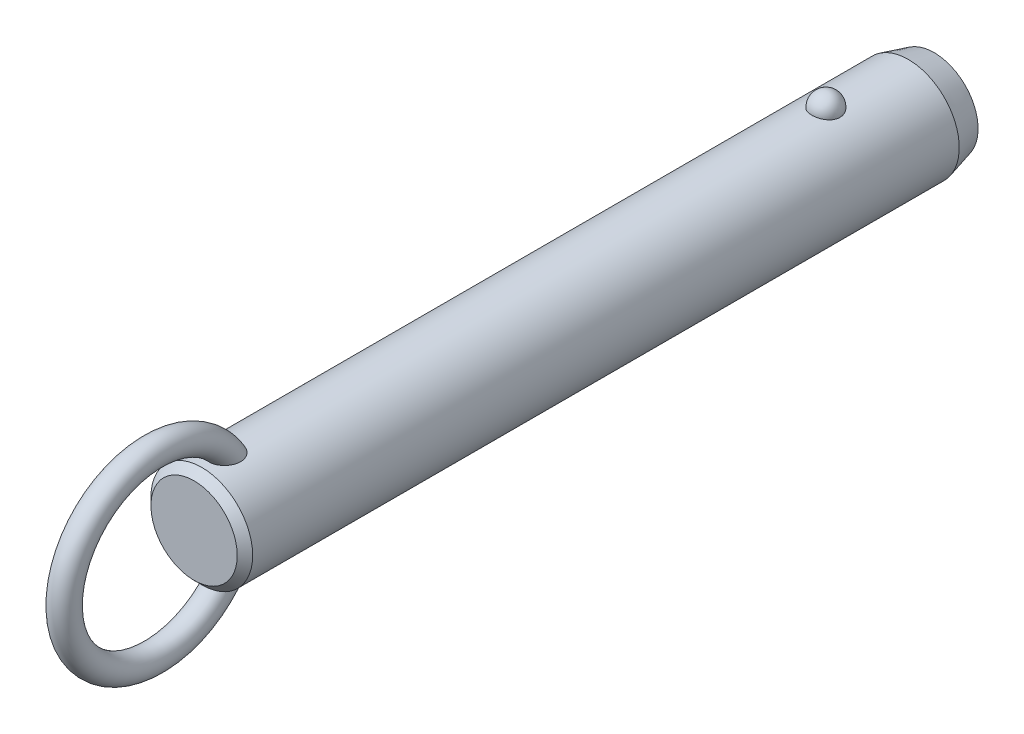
ISO-10303-21;
HEADER;
FILE_DESCRIPTION(('STEP AP214'),'2;1');
FILE_NAME('part.step','',(''),(''),'','','');
FILE_SCHEMA(('AUTOMOTIVE_DESIGN { 1 0 10303 214 1 1 1 1 }'));
ENDSEC;
DATA;
#1=APPLICATION_CONTEXT('core data for automotive mechanical design processes');
#2=APPLICATION_PROTOCOL_DEFINITION('international standard','automotive_design',2000,#1);
#3=PRODUCT_CONTEXT('',#1,'mechanical');
#4=PRODUCT('Part','Part','',(#3));
#5=PRODUCT_RELATED_PRODUCT_CATEGORY('part','',(#4));
#6=PRODUCT_DEFINITION_FORMATION('','',#4);
#7=PRODUCT_DEFINITION_CONTEXT('part definition',#1,'design');
#8=PRODUCT_DEFINITION('design','',#6,#7);
#9=PRODUCT_DEFINITION_SHAPE('','',#8);
#10=(LENGTH_UNIT() NAMED_UNIT(*) SI_UNIT(.MILLI.,.METRE.));
#11=(NAMED_UNIT(*) PLANE_ANGLE_UNIT() SI_UNIT($,.RADIAN.));
#12=(NAMED_UNIT(*) SI_UNIT($,.STERADIAN.) SOLID_ANGLE_UNIT());
#13=UNCERTAINTY_MEASURE_WITH_UNIT(LENGTH_MEASURE(1.E-05),#10,'distance_accuracy_value','');
#14=(GEOMETRIC_REPRESENTATION_CONTEXT(3) GLOBAL_UNCERTAINTY_ASSIGNED_CONTEXT((#13)) GLOBAL_UNIT_ASSIGNED_CONTEXT((#10,
#11,#12)) REPRESENTATION_CONTEXT('',''));
#15=CARTESIAN_POINT('',(0.,0.,0.));
#16=DIRECTION('',(0.,0.,1.));
#17=DIRECTION('',(1.,0.,0.));
#18=AXIS2_PLACEMENT_3D('',#15,#16,#17);
#19=CARTESIAN_POINT('',(0.,0.,86.4));
#20=DIRECTION('',(0.,0.,-1.));
#21=DIRECTION('',(-1.,0.,0.));
#22=AXIS2_PLACEMENT_3D('',#19,#20,#21);
#23=CYLINDRICAL_SURFACE('',#22,7.9);
#24=CARTESIAN_POINT('',(2.1785689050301,7.59367088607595,-2.19999999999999));
#25=CARTESIAN_POINT('',(2.17856679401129,7.59367269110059,-2.07701843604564));
#26=CARTESIAN_POINT('',(2.16853481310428,7.59657145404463,-1.95401006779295));
#27=CARTESIAN_POINT('',(2.12864689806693,7.607843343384,-1.71147811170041));
#28=CARTESIAN_POINT('',(2.09878338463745,7.61621856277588,-1.59195587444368));
#29=CARTESIAN_POINT('',(2.0199931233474,7.63749180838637,-1.3598563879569));
#30=CARTESIAN_POINT('',(1.97107475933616,7.65038784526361,-1.24727610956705));
#31=CARTESIAN_POINT('',(1.85539377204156,7.67926115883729,-1.03213234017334));
#32=CARTESIAN_POINT('',(1.78863158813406,7.69523835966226,-0.929568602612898));
#33=CARTESIAN_POINT('',(1.63856494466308,7.7285848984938,-0.736786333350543));
#34=CARTESIAN_POINT('',(1.55518140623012,7.7459606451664,-0.646630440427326));
#35=CARTESIAN_POINT('',(1.37422937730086,7.78009978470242,-0.481747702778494));
#36=CARTESIAN_POINT('',(1.27666086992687,7.7968631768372,-0.407020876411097));
#37=CARTESIAN_POINT('',(1.07024728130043,7.82786153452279,-0.275278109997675));
#38=CARTESIAN_POINT('',(0.961434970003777,7.84210353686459,-0.218212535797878));
#39=CARTESIAN_POINT('',(0.735351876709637,7.86652194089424,-0.123146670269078));
#40=CARTESIAN_POINT('',(0.618082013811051,7.87669878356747,-0.0851443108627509));
#41=CARTESIAN_POINT('',(0.380637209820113,7.89170521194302,-0.0298158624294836));
#42=CARTESIAN_POINT('',(0.260550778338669,7.89662650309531,-0.0121347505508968));
#43=CARTESIAN_POINT('',(0.0190117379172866,7.90090003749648,0.00324379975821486));
#44=CARTESIAN_POINT('',(-0.10244074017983,7.90025280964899,0.000943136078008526));
#45=CARTESIAN_POINT('',(-0.341452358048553,7.89351056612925,-0.0233955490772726));
#46=CARTESIAN_POINT('',(-0.45904225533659,7.88749257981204,-0.0451545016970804));
#47=CARTESIAN_POINT('',(-0.688796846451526,7.87075812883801,-0.107408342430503));
#48=CARTESIAN_POINT('',(-0.800961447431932,7.86004158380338,-0.147903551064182));
#49=CARTESIAN_POINT('',(-1.01743634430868,7.83497131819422,-0.246799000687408));
#50=CARTESIAN_POINT('',(-1.12169791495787,7.82059709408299,-0.305300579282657));
#51=CARTESIAN_POINT('',(-1.31891765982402,7.78976470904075,-0.438549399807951));
#52=CARTESIAN_POINT('',(-1.41187469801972,7.77330633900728,-0.513298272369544));
#53=CARTESIAN_POINT('',(-1.58577142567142,7.73972434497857,-0.678622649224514));
#54=CARTESIAN_POINT('',(-1.66645140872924,7.72259402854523,-0.769470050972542));
#55=CARTESIAN_POINT('',(-1.81161503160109,7.68983776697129,-0.963538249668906));
#56=CARTESIAN_POINT('',(-1.87609753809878,7.6742119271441,-1.06675991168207));
#57=CARTESIAN_POINT('',(-1.98790138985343,7.6460202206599,-1.28401170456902));
#58=CARTESIAN_POINT('',(-2.03501994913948,7.63349104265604,-1.39815107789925));
#59=CARTESIAN_POINT('',(-2.10986724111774,7.6131449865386,-1.63301784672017));
#60=CARTESIAN_POINT('',(-2.1375965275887,7.60532797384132,-1.75374505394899));
#61=CARTESIAN_POINT('',(-2.17289256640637,7.59531950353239,-1.99782562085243));
#62=CARTESIAN_POINT('',(-2.18054294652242,7.59310471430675,-2.12116592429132));
#63=CARTESIAN_POINT('',(-2.17572919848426,7.59448538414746,-2.36741799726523));
#64=CARTESIAN_POINT('',(-2.1632656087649,7.59808068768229,-2.49032977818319));
#65=CARTESIAN_POINT('',(-2.11865035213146,7.61064035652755,-2.73161015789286));
#66=CARTESIAN_POINT('',(-2.08659579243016,7.61957823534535,-2.84999812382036));
#67=CARTESIAN_POINT('',(-2.00367799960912,7.64179982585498,-3.07955956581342));
#68=CARTESIAN_POINT('',(-1.9528140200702,7.65508371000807,-3.19073275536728));
#69=CARTESIAN_POINT('',(-1.83321113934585,7.68460381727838,-3.40337899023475));
#70=CARTESIAN_POINT('',(-1.76437735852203,7.70085556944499,-3.50479651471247));
#71=CARTESIAN_POINT('',(-1.61069526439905,7.73445734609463,-3.69446912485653));
#72=CARTESIAN_POINT('',(-1.52584634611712,7.75180741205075,-3.78272371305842));
#73=CARTESIAN_POINT('',(-1.34198059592,7.78574608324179,-3.94393987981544));
#74=CARTESIAN_POINT('',(-1.24291308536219,7.80233167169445,-4.01684434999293));
#75=CARTESIAN_POINT('',(-1.03352039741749,7.83281625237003,-4.14489386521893));
#76=CARTESIAN_POINT('',(-0.923196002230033,7.84671543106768,-4.20004014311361));
#77=CARTESIAN_POINT('',(-0.695822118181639,7.87011575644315,-4.29042017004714));
#78=CARTESIAN_POINT('',(-0.578872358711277,7.87966903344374,-4.32589112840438));
#79=CARTESIAN_POINT('',(-0.340410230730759,7.8935652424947,-4.37692226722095));
#80=CARTESIAN_POINT('',(-0.218898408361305,7.89790879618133,-4.39248482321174));
#81=CARTESIAN_POINT('',(0.0228107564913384,7.90087453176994,-4.40314405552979));
#82=CARTESIAN_POINT('',(0.142990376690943,7.89960185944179,-4.39861683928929));
#83=CARTESIAN_POINT('',(0.380829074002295,7.89171262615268,-4.37008293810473));
#84=CARTESIAN_POINT('',(0.498488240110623,7.8850962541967,-4.34607694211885));
#85=CARTESIAN_POINT('',(0.727535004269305,7.86726442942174,-4.27939317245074));
#86=CARTESIAN_POINT('',(0.838944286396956,7.85606616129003,-4.236785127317));
#87=CARTESIAN_POINT('',(1.05295421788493,7.83025654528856,-4.13408348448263));
#88=CARTESIAN_POINT('',(1.15555431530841,7.81564498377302,-4.07398879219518));
#89=CARTESIAN_POINT('',(1.35076763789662,7.7843022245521,-3.93687432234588));
#90=CARTESIAN_POINT('',(1.4432046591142,7.76754209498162,-3.85961036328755));
#91=CARTESIAN_POINT('',(1.6139111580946,7.73387857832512,-3.69076949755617));
#92=CARTESIAN_POINT('',(1.6921781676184,7.71697516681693,-3.59919010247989));
#93=CARTESIAN_POINT('',(1.83380875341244,7.6845643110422,-3.40247278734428));
#94=CARTESIAN_POINT('',(1.89689280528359,7.66908588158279,-3.29712873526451));
#95=CARTESIAN_POINT('',(2.0047823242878,7.64159441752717,-3.07707931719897));
#96=CARTESIAN_POINT('',(2.0495945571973,7.62958010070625,-2.96237743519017));
#97=CARTESIAN_POINT('',(2.11580183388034,7.61146617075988,-2.74040519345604));
#98=CARTESIAN_POINT('',(2.13929812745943,7.60484503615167,-2.63379846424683));
#99=CARTESIAN_POINT('',(2.17068242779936,7.59594664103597,-2.41813481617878));
#100=CARTESIAN_POINT('',(2.17857077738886,7.59366928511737,-2.30907795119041));
#101=CARTESIAN_POINT('',(2.1785689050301,7.59367088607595,-2.19999999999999));
#102=B_SPLINE_CURVE_WITH_KNOTS('',3,(#24,#25,#26,#27,#28,#29,#30,#31,#32,#33,#34,#35,#36,#37,
#38,#39,#40,#41,#42,#43,#44,#45,#46,#47,#48,#49,#50,#51,#52,#53,#54,#55,#56,#57,#58,#59,#60,#61,
#62,#63,#64,#65,#66,#67,#68,#69,#70,#71,#72,#73,#74,#75,#76,#77,#78,#79,#80,#81,#82,#83,#84,#85,
#86,#87,#88,#89,#90,#91,#92,#93,#94,#95,#96,#97,#98,#99,#100,#101),.UNSPECIFIED.,.T.,.F.,(4,2,2,
2,2,2,2,2,2,2,2,2,2,2,2,2,2,2,2,2,2,2,2,2,2,2,2,2,2,2,2,2,2,2,2,2,2,2,4),(0.,0.368552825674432,
0.737246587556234,1.10577831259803,1.4743009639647,1.84462067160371,2.21494081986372,
2.58421058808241,2.95344028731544,3.31611630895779,3.67875788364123,4.03628044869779,
4.39380913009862,4.75338791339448,5.11300280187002,5.47939989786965,5.8458226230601,
6.21639834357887,6.58696347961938,6.95598276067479,7.32499216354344,7.69218715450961,
8.0593967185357,8.42858578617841,8.79778880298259,9.16834203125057,9.5388695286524,
9.90482699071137,10.2707407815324,10.6298333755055,10.9889132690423,11.3466585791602,
11.7044262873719,12.0676511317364,12.4309391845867,12.8004764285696,13.1698767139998,
13.4967701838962,13.8236564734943),.UNSPECIFIED.);
#103=CARTESIAN_POINT('',(2.1785689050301,7.59367088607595,-2.19999999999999));
#104=VERTEX_POINT('',#103);
#105=EDGE_CURVE('E41',#104,#104,#102,.T.);
#106=ORIENTED_EDGE('',*,*,#105,.T.);
#107=EDGE_LOOP('',(#106));
#108=FACE_BOUND('',#107,.T.);
#109=CARTESIAN_POINT('',(0.,0.,94.7200000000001));
#110=DIRECTION('',(0.,0.,1.));
#111=DIRECTION('',(1.,0.,0.));
#112=AXIS2_PLACEMENT_3D('',#109,#110,#111);
#113=CIRCLE('',#112,7.9);
#114=CARTESIAN_POINT('',(7.9,0.,94.7200000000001));
#115=VERTEX_POINT('',#114);
#116=EDGE_CURVE('E10',#115,#115,#113,.F.);
#117=ORIENTED_EDGE('',*,*,#116,.T.);
#118=EDGE_LOOP('',(#117));
#119=FACE_BOUND('',#118,.T.);
#120=CARTESIAN_POINT('',(-0.630969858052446,-7.87476203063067,88.6124322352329));
#121=CARTESIAN_POINT('',(-0.734180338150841,-7.8664899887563,88.647285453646));
#122=CARTESIAN_POINT('',(-0.834476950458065,-7.85639291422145,88.6908160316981));
#123=CARTESIAN_POINT('',(-1.02620356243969,-7.83366343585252,88.7940948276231));
#124=CARTESIAN_POINT('',(-1.1176141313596,-7.82102565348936,88.8538775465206));
#125=CARTESIAN_POINT('',(-1.28877277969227,-7.79464922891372,88.9878390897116));
#126=CARTESIAN_POINT('',(-1.36854014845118,-7.78091246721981,89.061993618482));
#127=CARTESIAN_POINT('',(-1.5146152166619,-7.75380398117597,89.2224941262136));
#128=CARTESIAN_POINT('',(-1.58092966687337,-7.74043207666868,89.3088339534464));
#129=CARTESIAN_POINT('',(-1.70019064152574,-7.71512522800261,89.4929784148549));
#130=CARTESIAN_POINT('',(-1.75284037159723,-7.70322473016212,89.5909792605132));
#131=CARTESIAN_POINT('',(-1.84263464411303,-7.68224112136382,89.7941029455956));
#132=CARTESIAN_POINT('',(-1.87977299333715,-7.6731591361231,89.8992286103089));
#133=CARTESIAN_POINT('',(-1.94152728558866,-7.65777930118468,90.1232849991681));
#134=CARTESIAN_POINT('',(-1.96475471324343,-7.65179654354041,90.2426167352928));
#135=CARTESIAN_POINT('',(-1.99449499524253,-7.64409642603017,90.4834298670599));
#136=CARTESIAN_POINT('',(-2.0010005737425,-7.64238092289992,90.6049121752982));
#137=CARTESIAN_POINT('',(-1.99856014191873,-7.64302120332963,90.8683409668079));
#138=CARTESIAN_POINT('',(-1.98680021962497,-7.64611845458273,91.0102565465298));
#139=CARTESIAN_POINT('',(-1.9445777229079,-7.65696186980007,91.2911188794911));
#140=CARTESIAN_POINT('',(-1.91409393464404,-7.66471330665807,91.4300620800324));
#141=CARTESIAN_POINT('',(-1.82768670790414,-7.68582947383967,91.7319397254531));
#142=CARTESIAN_POINT('',(-1.76772963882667,-7.70003779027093,91.893686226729));
#143=CARTESIAN_POINT('',(-1.65998501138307,-7.72371550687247,92.1276956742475));
#144=CARTESIAN_POINT('',(-1.621079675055,-7.73200670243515,92.2042974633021));
#145=CARTESIAN_POINT('',(-1.53727726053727,-7.74910377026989,92.3540798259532));
#146=CARTESIAN_POINT('',(-1.49238215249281,-7.75790947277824,92.4272615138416));
#147=CARTESIAN_POINT('',(-1.3739705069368,-7.77993338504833,92.6028838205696));
#148=CARTESIAN_POINT('',(-1.29690364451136,-7.79328473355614,92.7029557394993));
#149=CARTESIAN_POINT('',(-1.12885487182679,-7.81939266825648,92.8907147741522));
#150=CARTESIAN_POINT('',(-1.03789926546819,-7.83215032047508,92.9784247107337));
#151=CARTESIAN_POINT('',(-0.869532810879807,-7.85231710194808,93.1134148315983));
#152=CARTESIAN_POINT('',(-0.795716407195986,-7.86021093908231,93.165076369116));
#153=CARTESIAN_POINT('',(-0.64081313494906,-7.87434920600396,93.2563815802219));
#154=CARTESIAN_POINT('',(-0.55973779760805,-7.88059619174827,93.2960438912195));
#155=CARTESIAN_POINT('',(-0.406456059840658,-7.88984116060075,93.3543008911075));
#156=CARTESIAN_POINT('',(-0.335227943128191,-7.89321892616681,93.3753848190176));
#157=CARTESIAN_POINT('',(-0.19019307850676,-7.89804235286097,93.4054141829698));
#158=CARTESIAN_POINT('',(-0.11638863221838,-7.89948969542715,93.4143701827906));
#159=CARTESIAN_POINT('',(0.0318414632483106,-7.90028409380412,93.4192915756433));
#160=CARTESIAN_POINT('',(0.106268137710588,-7.89962640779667,93.4152276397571));
#161=CARTESIAN_POINT('',(0.253290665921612,-7.8962818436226,93.3944615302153));
#162=CARTESIAN_POINT('',(0.325885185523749,-7.8935935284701,93.3777504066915));
#163=CARTESIAN_POINT('',(0.481441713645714,-7.88577340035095,93.3287380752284));
#164=CARTESIAN_POINT('',(0.563611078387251,-7.88026321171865,93.294005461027));
#165=CARTESIAN_POINT('',(0.721129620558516,-7.86741729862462,93.2117965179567));
#166=CARTESIAN_POINT('',(0.796466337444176,-7.86007832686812,93.1642975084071));
#167=CARTESIAN_POINT('',(0.971456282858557,-7.84073285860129,93.036513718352));
#168=CARTESIAN_POINT('',(1.0671968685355,-7.82809461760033,92.9510047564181));
#169=CARTESIAN_POINT('',(1.24418921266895,-7.80192439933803,92.766232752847));
#170=CARTESIAN_POINT('',(1.32540832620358,-7.78839049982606,92.6669395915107));
#171=CARTESIAN_POINT('',(1.45199971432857,-7.76559693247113,92.4895760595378));
#172=CARTESIAN_POINT('',(1.50085649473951,-7.75626094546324,92.4139542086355));
#173=CARTESIAN_POINT('',(1.59197749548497,-7.7380727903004,92.2587428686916));
#174=CARTESIAN_POINT('',(1.63423919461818,-7.72922080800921,92.1791518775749));
#175=CARTESIAN_POINT('',(1.71222612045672,-7.71231959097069,92.0166640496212));
#176=CARTESIAN_POINT('',(1.7479451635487,-7.70427111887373,91.933764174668));
#177=CARTESIAN_POINT('',(1.81270113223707,-7.68929240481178,91.7652967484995));
#178=CARTESIAN_POINT('',(1.84173789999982,-7.68236218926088,91.6797291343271));
#179=CARTESIAN_POINT('',(1.89322698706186,-7.6698375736,91.5052870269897));
#180=CARTESIAN_POINT('',(1.91558744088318,-7.66426199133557,91.4163838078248));
#181=CARTESIAN_POINT('',(1.95281367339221,-7.65485915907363,91.2369696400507));
#182=CARTESIAN_POINT('',(1.96767946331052,-7.65103190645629,91.1464586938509));
#183=CARTESIAN_POINT('',(2.00021456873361,-7.64262981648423,90.8737320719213));
#184=CARTESIAN_POINT('',(2.00600691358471,-7.6410871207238,90.6897099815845));
#185=CARTESIAN_POINT('',(1.98445334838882,-7.64669564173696,90.3765019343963));
#186=CARTESIAN_POINT('',(1.96607186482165,-7.65149688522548,90.246618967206));
#187=CARTESIAN_POINT('',(1.90884967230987,-7.6659762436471,89.9916321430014));
#188=CARTESIAN_POINT('',(1.87002101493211,-7.67565148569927,89.866525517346));
#189=CARTESIAN_POINT('',(1.77063986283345,-7.69918471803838,89.6245401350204));
#190=CARTESIAN_POINT('',(1.7099372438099,-7.71307150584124,89.5077250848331));
#191=CARTESIAN_POINT('',(1.56733070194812,-7.74330306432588,89.2881444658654));
#192=CARTESIAN_POINT('',(1.48543692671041,-7.75964665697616,89.1853722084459));
#193=CARTESIAN_POINT('',(1.31346177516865,-7.79047523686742,89.0093800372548));
#194=CARTESIAN_POINT('',(1.22547278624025,-7.80495298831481,88.9341066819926));
#195=CARTESIAN_POINT('',(1.03724352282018,-7.83218597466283,88.8004864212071));
#196=CARTESIAN_POINT('',(0.937008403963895,-7.84494192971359,88.7421324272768));
#197=CARTESIAN_POINT('',(0.733599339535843,-7.86649045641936,88.6470270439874));
#198=CARTESIAN_POINT('',(0.630941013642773,-7.87547134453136,88.6092109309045));
#199=CARTESIAN_POINT('',(0.420465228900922,-7.88950708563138,88.5511160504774));
#200=CARTESIAN_POINT('',(0.312645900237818,-7.89456050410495,88.5308436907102));
#201=CARTESIAN_POINT('',(0.0960869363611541,-7.9001518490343,88.5084559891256));
#202=CARTESIAN_POINT('',(-0.0126341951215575,-7.90073226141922,88.5061698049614));
#203=CARTESIAN_POINT('',(-0.228766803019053,-7.89742350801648,88.5193678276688));
#204=CARTESIAN_POINT('',(-0.336180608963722,-7.89354403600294,88.5348134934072));
#205=CARTESIAN_POINT('',(-0.473410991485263,-7.88586871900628,88.5662177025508));
#206=CARTESIAN_POINT('',(-0.5052577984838,-7.88388984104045,88.5743541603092));
#207=CARTESIAN_POINT('',(-0.568481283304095,-7.87958326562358,88.5922083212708));
#208=CARTESIAN_POINT('',(-0.599857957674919,-7.87725556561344,88.6019260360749));
#209=CARTESIAN_POINT('',(-0.630969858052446,-7.87476203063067,88.6124322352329));
#210=B_SPLINE_CURVE_WITH_KNOTS('',3,(#120,#121,#122,#123,#124,#125,#126,#127,#128,#129,#130,
#131,#132,#133,#134,#135,#136,#137,#138,#139,#140,#141,#142,#143,#144,#145,#146,#147,#148,#149,
#150,#151,#152,#153,#154,#155,#156,#157,#158,#159,#160,#161,#162,#163,#164,#165,#166,#167,#168,
#169,#170,#171,#172,#173,#174,#175,#176,#177,#178,#179,#180,#181,#182,#183,#184,#185,#186,#187,
#188,#189,#190,#191,#192,#193,#194,#195,#196,#197,#198,#199,#200,#201,#202,#203,#204,#205,#206,
#207,#208,#209),.UNSPECIFIED.,.T.,.F.,(4,2,2,2,2,2,2,2,2,2,2,2,2,2,2,2,2,2,2,2,2,2,2,2,2,2,2,2,
2,2,2,2,2,2,2,2,2,2,2,2,2,2,2,2,4),(0.,0.327622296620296,0.655945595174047,0.983718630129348,
1.3113267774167,1.64554655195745,1.97989964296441,2.3436572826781,2.70757317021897,
3.13333684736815,3.55958380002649,4.07655306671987,4.33527897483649,4.59391999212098,
4.97382437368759,5.35301797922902,5.62348245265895,5.89352465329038,6.11565959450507,
6.33760092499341,6.56004255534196,6.78264174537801,7.04930844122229,7.31645206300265,
7.70130871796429,8.08701995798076,8.35824509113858,8.62957365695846,8.90115735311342,
9.17274746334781,9.44791855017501,9.72308922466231,10.2715298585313,10.6638393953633,
11.0559179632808,11.4507403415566,11.845374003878,12.1936425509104,12.5417649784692,
12.8695063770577,13.1973674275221,13.5221104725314,13.8461490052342,13.9449071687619,
14.0436660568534),.UNSPECIFIED.);
#211=CARTESIAN_POINT('',(-0.630969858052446,-7.87476203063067,88.6124322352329));
#212=VERTEX_POINT('',#211);
#213=EDGE_CURVE('E60',#212,#212,#210,.T.);
#214=ORIENTED_EDGE('',*,*,#213,.T.);
#215=EDGE_LOOP('',(#214));
#216=FACE_BOUND('',#215,.T.);
#217=CARTESIAN_POINT('',(-0.630969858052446,7.87476203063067,88.6124322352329));
#218=CARTESIAN_POINT('',(-0.528918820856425,7.88293636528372,88.5779798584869));
#219=CARTESIAN_POINT('',(-0.423745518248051,7.8893481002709,88.551915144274));
#220=CARTESIAN_POINT('',(-0.210236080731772,7.8979273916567,88.5172825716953));
#221=CARTESIAN_POINT('',(-0.10189380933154,7.90008607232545,88.5087513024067));
#222=CARTESIAN_POINT('',(0.114660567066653,7.89990877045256,88.5094570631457));
#223=CARTESIAN_POINT('',(0.222872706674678,7.89757640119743,88.5186798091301));
#224=CARTESIAN_POINT('',(0.436107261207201,7.88867538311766,88.5546525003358));
#225=CARTESIAN_POINT('',(0.541131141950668,7.8821087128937,88.5813942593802));
#226=CARTESIAN_POINT('',(0.745085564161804,7.86545130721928,88.6517561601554));
#227=CARTESIAN_POINT('',(0.844015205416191,7.85536005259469,88.6953787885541));
#228=CARTESIAN_POINT('',(1.03299167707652,7.83275153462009,88.7983796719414));
#229=CARTESIAN_POINT('',(1.12303841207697,7.8202342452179,88.8577580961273));
#230=CARTESIAN_POINT('',(1.29214734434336,7.79408219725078,88.9908647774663));
#231=CARTESIAN_POINT('',(1.37116907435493,7.78044359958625,89.0646436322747));
#232=CARTESIAN_POINT('',(1.51597677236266,7.75353170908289,89.2242353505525));
#233=CARTESIAN_POINT('',(1.58176261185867,7.74025841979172,89.3100483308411));
#234=CARTESIAN_POINT('',(1.70057386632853,7.71504069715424,89.493644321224));
#235=CARTESIAN_POINT('',(1.75320073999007,7.7031425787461,89.5916906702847));
#236=CARTESIAN_POINT('',(1.84293767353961,7.68216822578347,89.7948931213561));
#237=CARTESIAN_POINT('',(1.88004278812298,7.67309289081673,89.9000514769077));
#238=CARTESIAN_POINT('',(1.9417232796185,7.6577294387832,90.1241671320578));
#239=CARTESIAN_POINT('',(1.96491037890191,7.65175648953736,90.2435248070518));
#240=CARTESIAN_POINT('',(1.9945689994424,7.64407702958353,90.4843848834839));
#241=CARTESIAN_POINT('',(2.00103304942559,7.64237242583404,90.6058882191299));
#242=CARTESIAN_POINT('',(1.9985016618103,7.64303650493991,90.8693688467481));
#243=CARTESIAN_POINT('',(1.98669038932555,7.64614714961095,91.0113141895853));
#244=CARTESIAN_POINT('',(1.94436120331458,7.6570170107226,91.2922287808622));
#245=CARTESIAN_POINT('',(1.91382203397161,7.66478150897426,91.4311944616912));
#246=CARTESIAN_POINT('',(1.82728754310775,7.68592483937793,91.7331110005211));
#247=CARTESIAN_POINT('',(1.76725778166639,7.70014685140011,91.894872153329));
#248=CARTESIAN_POINT('',(1.65939700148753,7.72384204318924,92.1288914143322));
#249=CARTESIAN_POINT('',(1.62045187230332,7.73213852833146,92.2054942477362));
#250=CARTESIAN_POINT('',(1.53656684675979,7.74924489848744,92.3552737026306));
#251=CARTESIAN_POINT('',(1.49162892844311,7.75805461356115,92.4284514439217));
#252=CARTESIAN_POINT('',(1.37317698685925,7.78007342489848,92.6039520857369));
#253=CARTESIAN_POINT('',(1.29612360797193,7.79341423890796,92.7039112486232));
#254=CARTESIAN_POINT('',(1.12812043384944,7.81949839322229,92.8914508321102));
#255=CARTESIAN_POINT('',(1.03719688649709,7.83224280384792,92.9790540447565));
#256=CARTESIAN_POINT('',(0.868871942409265,7.85239026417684,93.1138971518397));
#257=CARTESIAN_POINT('',(0.795056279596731,7.86027769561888,93.1655113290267));
#258=CARTESIAN_POINT('',(0.640160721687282,7.87440222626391,93.2567201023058));
#259=CARTESIAN_POINT('',(0.559092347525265,7.88064188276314,93.2963333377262));
#260=CARTESIAN_POINT('',(0.405820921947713,7.8898738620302,93.3545056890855));
#261=CARTESIAN_POINT('',(0.334594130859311,7.89324577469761,93.3755523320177));
#262=CARTESIAN_POINT('',(0.189568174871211,7.89805733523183,93.4055070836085));
#263=CARTESIAN_POINT('',(0.115771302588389,7.89949866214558,93.4144257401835));
#264=CARTESIAN_POINT('',(-0.032435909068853,7.90028156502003,93.4192758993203));
#265=CARTESIAN_POINT('',(-0.106847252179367,7.89961843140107,93.4151782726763));
#266=CARTESIAN_POINT('',(-0.253834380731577,7.8962642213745,93.3943519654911));
#267=CARTESIAN_POINT('',(-0.326408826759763,7.89357170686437,93.3776143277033));
#268=CARTESIAN_POINT('',(-0.481962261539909,7.88574179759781,93.3285391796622));
#269=CARTESIAN_POINT('',(-0.564145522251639,7.88022507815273,93.2937638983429));
#270=CARTESIAN_POINT('',(-0.721685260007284,7.8673664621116,93.2114686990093));
#271=CARTESIAN_POINT('',(-0.797029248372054,7.8600213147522,93.1639260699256));
#272=CARTESIAN_POINT('',(-0.972044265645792,7.84066026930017,93.0360267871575));
#273=CARTESIAN_POINT('',(-1.06779803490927,7.82801274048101,92.9504436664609));
#274=CARTESIAN_POINT('',(-1.24480531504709,7.80182621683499,92.7655223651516));
#275=CARTESIAN_POINT('',(-1.3260261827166,7.78828530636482,92.6661540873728));
#276=CARTESIAN_POINT('',(-1.45259834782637,7.76548487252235,92.4886806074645));
#277=CARTESIAN_POINT('',(-1.50143856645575,7.75614818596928,92.4130252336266));
#278=CARTESIAN_POINT('',(-1.59252410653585,7.73796020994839,92.2577484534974));
#279=CARTESIAN_POINT('',(-1.63476690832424,7.72910910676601,92.1781255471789));
#280=CARTESIAN_POINT('',(-1.71271318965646,7.71221133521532,92.0155750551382));
#281=CARTESIAN_POINT('',(-1.74841047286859,7.70416543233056,91.9326444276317));
#282=CARTESIAN_POINT('',(-1.81311929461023,7.68919371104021,91.7641168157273));
#283=CARTESIAN_POINT('',(-1.84213067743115,7.6822679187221,91.6785197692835));
#284=CARTESIAN_POINT('',(-1.89356259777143,7.66975461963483,91.5040254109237));
#285=CARTESIAN_POINT('',(-1.91589165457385,7.66418586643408,91.4150995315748));
#286=CARTESIAN_POINT('',(-1.95305070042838,7.65479859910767,91.2356424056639));
#287=CARTESIAN_POINT('',(-1.96788069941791,7.65098008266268,91.1451111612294));
#288=CARTESIAN_POINT('',(-2.00030078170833,7.64260704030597,90.8723270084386));
#289=CARTESIAN_POINT('',(-2.00600576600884,7.64108760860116,90.6882718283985));
#290=CARTESIAN_POINT('',(-1.98428483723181,7.64673945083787,90.3750800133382));
#291=CARTESIAN_POINT('',(-1.96583698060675,7.6515575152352,90.2452400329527));
#292=CARTESIAN_POINT('',(-1.90848948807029,7.66606613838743,89.9903619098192));
#293=CARTESIAN_POINT('',(-1.86960376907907,7.67575338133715,89.865320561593));
#294=CARTESIAN_POINT('',(-1.7701342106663,7.69930132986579,89.6235009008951));
#295=CARTESIAN_POINT('',(-1.70940488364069,7.71318991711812,89.5067844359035));
#296=CARTESIAN_POINT('',(-1.56672953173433,7.74342495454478,89.2873404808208));
#297=CARTESIAN_POINT('',(-1.48478316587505,7.75977144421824,89.1846132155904));
#298=CARTESIAN_POINT('',(-1.31266325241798,7.79061163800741,89.0086431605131));
#299=CARTESIAN_POINT('',(-1.22456383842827,7.80509908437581,88.9333589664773));
#300=CARTESIAN_POINT('',(-1.03622400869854,7.83231881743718,88.7998659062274));
#301=CARTESIAN_POINT('',(-0.936015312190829,7.84505551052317,88.7416137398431));
#302=CARTESIAN_POINT('',(-0.798824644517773,7.85957802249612,88.6775408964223));
#303=CARTESIAN_POINT('',(-0.765787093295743,7.86286821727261,88.6632248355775));
#304=CARTESIAN_POINT('',(-0.698939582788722,7.86909211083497,88.636436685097));
#305=CARTESIAN_POINT('',(-0.66512963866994,7.8720258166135,88.6239645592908));
#306=CARTESIAN_POINT('',(-0.630969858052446,7.87476203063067,88.6124322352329));
#307=B_SPLINE_CURVE_WITH_KNOTS('',3,(#217,#218,#219,#220,#221,#222,#223,#224,#225,#226,#227,
#228,#229,#230,#231,#232,#233,#234,#235,#236,#237,#238,#239,#240,#241,#242,#243,#244,#245,#246,
#247,#248,#249,#250,#251,#252,#253,#254,#255,#256,#257,#258,#259,#260,#261,#262,#263,#264,#265,
#266,#267,#268,#269,#270,#271,#272,#273,#274,#275,#276,#277,#278,#279,#280,#281,#282,#283,#284,
#285,#286,#287,#288,#289,#290,#291,#292,#293,#294,#295,#296,#297,#298,#299,#300,#301,#302,#303,
#304,#305,#306),.UNSPECIFIED.,.T.,.F.,(4,2,2,2,2,2,2,2,2,2,2,2,2,2,2,2,2,2,2,2,2,2,2,2,2,2,2,2,
2,2,2,2,2,2,2,2,2,2,2,2,2,2,2,2,4),(0.,0.323920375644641,0.648516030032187,0.97285063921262,
1.29703380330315,1.62126473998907,1.94549915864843,2.27089401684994,2.5962920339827,
2.93059633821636,3.26500707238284,3.6288164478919,3.99278833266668,4.41865421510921,
4.84500434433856,5.36209210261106,5.62087589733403,5.87957448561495,6.25918598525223,
6.63808782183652,6.90846748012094,7.17842501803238,7.40052350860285,7.62242871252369,
7.84483086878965,8.06739077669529,8.33414615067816,8.60137921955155,8.98641454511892,
9.37230415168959,9.64358673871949,9.91497268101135,10.1866142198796,10.4582620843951,
10.7334745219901,11.0086865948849,11.5572126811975,11.9494246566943,12.3413699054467,
12.7359755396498,13.1305875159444,13.4791770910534,13.82687259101,13.9353013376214,
14.0437279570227),.UNSPECIFIED.);
#308=CARTESIAN_POINT('',(-0.630969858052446,7.87476203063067,88.6124322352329));
#309=VERTEX_POINT('',#308);
#310=EDGE_CURVE('E67',#309,#309,#307,.T.);
#311=ORIENTED_EDGE('',*,*,#310,.T.);
#312=EDGE_LOOP('',(#311));
#313=FACE_BOUND('',#312,.T.);
#314=CARTESIAN_POINT('',(0.,0.,-15.));
#315=DIRECTION('',(0.,0.,-1.));
#316=DIRECTION('',(-1.,0.,0.));
#317=AXIS2_PLACEMENT_3D('',#314,#315,#316);
#318=CIRCLE('',#317,7.9);
#319=CARTESIAN_POINT('',(-7.9,0.,-15.));
#320=VERTEX_POINT('',#319);
#321=EDGE_CURVE('E57',#320,#320,#318,.F.);
#322=ORIENTED_EDGE('',*,*,#321,.T.);
#323=EDGE_LOOP('',(#322));
#324=FACE_BOUND('',#323,.T.);
#325=ADVANCED_FACE('F37',(#108,#119,#216,#313,#324),#23,.T.);
#326=CARTESIAN_POINT('',(0.,0.,-19.));
#327=DIRECTION('',(0.,0.,-1.));
#328=DIRECTION('',(-1.,0.,0.));
#329=AXIS2_PLACEMENT_3D('',#326,#327,#328);
#330=PLANE('',#329);
#331=CARTESIAN_POINT('',(0.,0.,-19.));
#332=DIRECTION('',(0.,0.,-1.));
#333=DIRECTION('',(-1.,0.,0.));
#334=AXIS2_PLACEMENT_3D('',#331,#332,#333);
#335=CIRCLE('',#334,6.82820323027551);
#336=CARTESIAN_POINT('',(-6.82820323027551,0.,-19.));
#337=VERTEX_POINT('',#336);
#338=EDGE_CURVE('E66',#337,#337,#335,.T.);
#339=ORIENTED_EDGE('',*,*,#338,.T.);
#340=EDGE_LOOP('',(#339));
#341=FACE_BOUND('',#340,.T.);
#342=ADVANCED_FACE('F85',(#341),#330,.T.);
#343=CARTESIAN_POINT('',(0.,0.,-19.));
#344=DIRECTION('',(0.,0.,1.));
#345=DIRECTION('',(1.,0.,0.));
#346=AXIS2_PLACEMENT_3D('',#343,#344,#345);
#347=CONICAL_SURFACE('',#346,6.82820323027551,0.261799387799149);
#348=ORIENTED_EDGE('',*,*,#321,.F.);
#349=EDGE_LOOP('',(#348));
#350=FACE_BOUND('',#349,.T.);
#351=ORIENTED_EDGE('',*,*,#338,.F.);
#352=EDGE_LOOP('',(#351));
#353=FACE_BOUND('',#352,.T.);
#354=ADVANCED_FACE('F83',(#350,#353),#347,.T.);
#355=CARTESIAN_POINT('',(0.,0.,95.92));
#356=DIRECTION('',(0.,0.,1.));
#357=DIRECTION('',(1.,0.,0.));
#358=AXIS2_PLACEMENT_3D('',#355,#356,#357);
#359=PLANE('',#358);
#360=CARTESIAN_POINT('',(0.,0.,95.92));
#361=DIRECTION('',(0.,0.,1.));
#362=DIRECTION('',(1.,0.,0.));
#363=AXIS2_PLACEMENT_3D('',#360,#361,#362);
#364=CIRCLE('',#363,6.70000000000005);
#365=CARTESIAN_POINT('',(6.70000000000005,0.,95.92));
#366=VERTEX_POINT('',#365);
#367=EDGE_CURVE('E50',#366,#366,#364,.T.);
#368=ORIENTED_EDGE('',*,*,#367,.T.);
#369=EDGE_LOOP('',(#368));
#370=FACE_BOUND('',#369,.T.);
#371=ADVANCED_FACE('F77',(#370),#359,.T.);
#372=CARTESIAN_POINT('',(0.,0.,102.25));
#373=DIRECTION('',(1.,0.,0.));
#374=DIRECTION('',(0.,0.,-1.));
#375=AXIS2_PLACEMENT_3D('',#372,#373,#374);
#376=TOROIDAL_SURFACE('',#375,13.85,2.);
#377=ORIENTED_EDGE('',*,*,#310,.F.);
#378=EDGE_LOOP('',(#377));
#379=FACE_BOUND('',#378,.T.);
#380=ORIENTED_EDGE('',*,*,#213,.F.);
#381=EDGE_LOOP('',(#380));
#382=FACE_BOUND('',#381,.T.);
#383=ADVANCED_FACE('F73',(#379,#382),#376,.T.);
#384=CARTESIAN_POINT('',(0.,0.,95.92));
#385=DIRECTION('',(0.,0.,-1.));
#386=DIRECTION('',(-1.,0.,0.));
#387=AXIS2_PLACEMENT_3D('',#384,#385,#386);
#388=CONICAL_SURFACE('',#387,6.70000000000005,0.785398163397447);
#389=ORIENTED_EDGE('',*,*,#116,.F.);
#390=EDGE_LOOP('',(#389));
#391=FACE_BOUND('',#390,.T.);
#392=ORIENTED_EDGE('',*,*,#367,.F.);
#393=EDGE_LOOP('',(#392));
#394=FACE_BOUND('',#393,.T.);
#395=ADVANCED_FACE('F39',(#391,#394),#388,.T.);
#396=CARTESIAN_POINT('',(0.,7.9,-2.19999999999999));
#397=DIRECTION('',(0.,1.,0.));
#398=DIRECTION('',(0.,0.,-1.));
#399=AXIS2_PLACEMENT_3D('',#396,#397,#398);
#400=SPHERICAL_SURFACE('',#399,2.2);
#401=ORIENTED_EDGE('',*,*,#105,.F.);
#402=EDGE_LOOP('',(#401));
#403=FACE_BOUND('',#402,.T.);
#404=ADVANCED_FACE('F79',(#403),#400,.T.);
#405=CLOSED_SHELL('',(#325,#342,#354,#371,#383,#395,#404));
#406=MANIFOLD_SOLID_BREP('B2',#405);
#407=ADVANCED_BREP_SHAPE_REPRESENTATION('',(#18,#406),#14);
#408=SHAPE_DEFINITION_REPRESENTATION(#9,#407);
ENDSEC;
END-ISO-10303-21;
